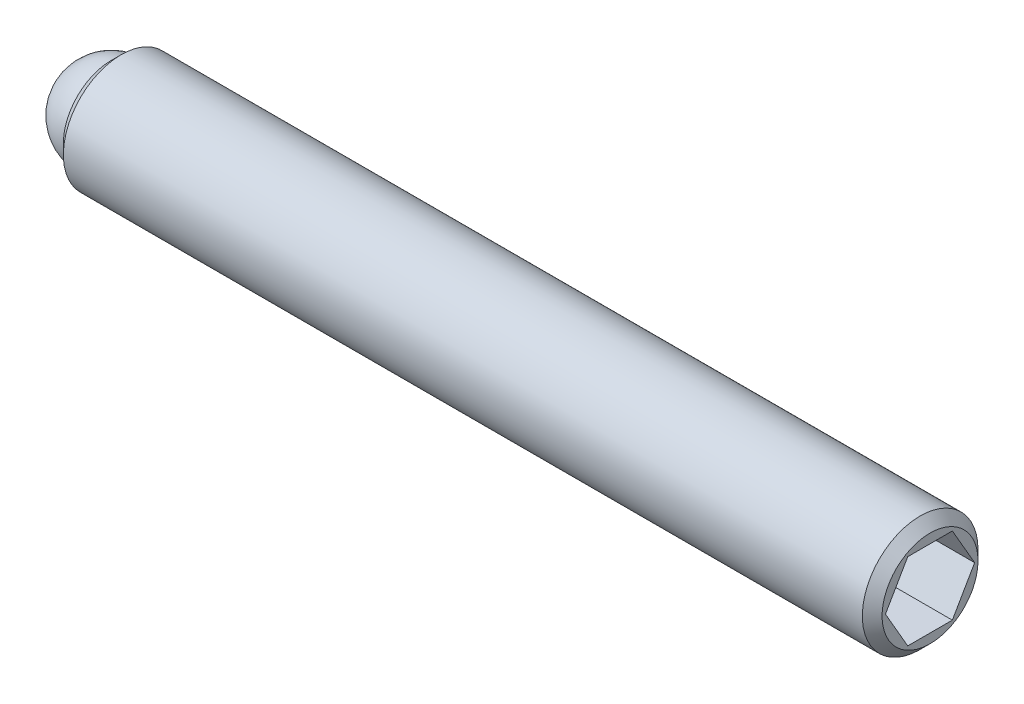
ISO-10303-21;
HEADER;
FILE_DESCRIPTION(('STEP AP214'),'2;1');
FILE_NAME('part.step','',(''),(''),'','','');
FILE_SCHEMA(('AUTOMOTIVE_DESIGN { 1 0 10303 214 1 1 1 1 }'));
ENDSEC;
DATA;
#1=APPLICATION_CONTEXT('core data for automotive mechanical design processes');
#2=APPLICATION_PROTOCOL_DEFINITION('international standard','automotive_design',2000,#1);
#3=PRODUCT_CONTEXT('',#1,'mechanical');
#4=PRODUCT('Part','Part','',(#3));
#5=PRODUCT_RELATED_PRODUCT_CATEGORY('part','',(#4));
#6=PRODUCT_DEFINITION_FORMATION('','',#4);
#7=PRODUCT_DEFINITION_CONTEXT('part definition',#1,'design');
#8=PRODUCT_DEFINITION('design','',#6,#7);
#9=PRODUCT_DEFINITION_SHAPE('','',#8);
#10=(LENGTH_UNIT() NAMED_UNIT(*) SI_UNIT(.MILLI.,.METRE.));
#11=(NAMED_UNIT(*) PLANE_ANGLE_UNIT() SI_UNIT($,.RADIAN.));
#12=(NAMED_UNIT(*) SI_UNIT($,.STERADIAN.) SOLID_ANGLE_UNIT());
#13=UNCERTAINTY_MEASURE_WITH_UNIT(LENGTH_MEASURE(1.E-05),#10,'distance_accuracy_value','');
#14=(GEOMETRIC_REPRESENTATION_CONTEXT(3) GLOBAL_UNCERTAINTY_ASSIGNED_CONTEXT((#13)) GLOBAL_UNIT_ASSIGNED_CONTEXT((#10,
#11,#12)) REPRESENTATION_CONTEXT('',''));
#15=CARTESIAN_POINT('',(0.,0.,0.));
#16=DIRECTION('',(0.,0.,1.));
#17=DIRECTION('',(1.,0.,0.));
#18=AXIS2_PLACEMENT_3D('',#15,#16,#17);
#19=CARTESIAN_POINT('',(0.,0.,0.));
#20=DIRECTION('',(0.,-1.,0.));
#21=DIRECTION('',(0.,0.,-1.));
#22=AXIS2_PLACEMENT_3D('',#19,#20,#21);
#23=SPHERICAL_SURFACE('',#22,1.190625);
#24=CARTESIAN_POINT('',(0.,-1.190625,0.));
#25=VERTEX_POINT('',#24);
#26=VERTEX_LOOP('',#25);
#27=FACE_BOUND('',#26,.T.);
#28=ADVANCED_FACE('F43',(#27),#23,.T.);
#29=CLOSED_SHELL('',(#28));
#30=MANIFOLD_SOLID_BREP('B2',#29);
#31=CARTESIAN_POINT('',(21.034375,0.,0.));
#32=DIRECTION('',(-1.,0.,0.));
#33=DIRECTION('',(0.,0.,1.));
#34=AXIS2_PLACEMENT_3D('',#31,#32,#33);
#35=CYLINDRICAL_SURFACE('',#34,1.4859);
#36=CARTESIAN_POINT('',(20.780375,0.,0.));
#37=DIRECTION('',(1.,0.,0.));
#38=DIRECTION('',(0.,0.,-1.));
#39=AXIS2_PLACEMENT_3D('',#36,#37,#38);
#40=CIRCLE('',#39,1.4859);
#41=CARTESIAN_POINT('',(20.780375,0.,-1.4859));
#42=VERTEX_POINT('',#41);
#43=EDGE_CURVE('E41',#42,#42,#40,.F.);
#44=ORIENTED_EDGE('',*,*,#43,.T.);
#45=EDGE_LOOP('',(#44));
#46=FACE_BOUND('',#45,.T.);
#47=CARTESIAN_POINT('',(0.254000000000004,0.,0.));
#48=DIRECTION('',(1.,0.,0.));
#49=DIRECTION('',(0.,0.,-1.));
#50=AXIS2_PLACEMENT_3D('',#47,#48,#49);
#51=CIRCLE('',#50,1.4859);
#52=CARTESIAN_POINT('',(0.254000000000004,0.,-1.4859));
#53=VERTEX_POINT('',#52);
#54=EDGE_CURVE('E159',#53,#53,#51,.T.);
#55=ORIENTED_EDGE('',*,*,#54,.T.);
#56=EDGE_LOOP('',(#55));
#57=FACE_BOUND('',#56,.T.);
#58=ADVANCED_FACE('F56',(#46,#57),#35,.T.);
#59=CARTESIAN_POINT('',(21.034375,0.,0.));
#60=DIRECTION('',(1.,0.,0.));
#61=DIRECTION('',(0.,0.,-1.));
#62=AXIS2_PLACEMENT_3D('',#59,#60,#61);
#63=PLANE('',#62);
#64=DIRECTION('',(0.,0.866025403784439,-0.5));
#65=VECTOR('',#64,1.);
#66=CARTESIAN_POINT('',(21.034375,-0.992187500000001,-0.572839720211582));
#67=LINE('',#66,#65);
#68=CARTESIAN_POINT('',(21.034375,-0.992187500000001,-0.572839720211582));
#69=VERTEX_POINT('',#68);
#70=CARTESIAN_POINT('',(21.034375,0.,-1.14567944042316));
#71=VERTEX_POINT('',#70);
#72=EDGE_CURVE('E71',#69,#71,#67,.T.);
#73=ORIENTED_EDGE('',*,*,#72,.F.);
#74=DIRECTION('',(0.,0.,-1.));
#75=VECTOR('',#74,1.);
#76=CARTESIAN_POINT('',(21.034375,-0.992187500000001,0.572839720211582));
#77=LINE('',#76,#75);
#78=CARTESIAN_POINT('',(21.034375,-0.992187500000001,0.572839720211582));
#79=VERTEX_POINT('',#78);
#80=EDGE_CURVE('E155',#79,#69,#77,.T.);
#81=ORIENTED_EDGE('',*,*,#80,.F.);
#82=DIRECTION('',(0.,-0.866025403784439,-0.5));
#83=VECTOR('',#82,1.);
#84=CARTESIAN_POINT('',(21.034375,0.,1.14567944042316));
#85=LINE('',#84,#83);
#86=CARTESIAN_POINT('',(21.034375,0.,1.14567944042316));
#87=VERTEX_POINT('',#86);
#88=EDGE_CURVE('E153',#87,#79,#85,.T.);
#89=ORIENTED_EDGE('',*,*,#88,.F.);
#90=DIRECTION('',(0.,-0.866025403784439,0.5));
#91=VECTOR('',#90,1.);
#92=CARTESIAN_POINT('',(21.034375,0.992187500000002,0.572839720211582));
#93=LINE('',#92,#91);
#94=CARTESIAN_POINT('',(21.034375,0.992187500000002,0.572839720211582));
#95=VERTEX_POINT('',#94);
#96=EDGE_CURVE('E119',#95,#87,#93,.T.);
#97=ORIENTED_EDGE('',*,*,#96,.F.);
#98=DIRECTION('',(0.,0.,1.));
#99=VECTOR('',#98,1.);
#100=CARTESIAN_POINT('',(21.034375,0.992187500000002,-0.572839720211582));
#101=LINE('',#100,#99);
#102=CARTESIAN_POINT('',(21.034375,0.992187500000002,-0.572839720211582));
#103=VERTEX_POINT('',#102);
#104=EDGE_CURVE('E149',#103,#95,#101,.T.);
#105=ORIENTED_EDGE('',*,*,#104,.F.);
#106=DIRECTION('',(0.,0.866025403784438,0.5));
#107=VECTOR('',#106,1.);
#108=CARTESIAN_POINT('',(21.034375,0.,-1.14567944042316));
#109=LINE('',#108,#107);
#110=EDGE_CURVE('E145',#71,#103,#109,.T.);
#111=ORIENTED_EDGE('',*,*,#110,.F.);
#112=EDGE_LOOP('',(#73,#81,#89,#97,#105,#111));
#113=FACE_BOUND('',#112,.T.);
#114=CARTESIAN_POINT('',(21.034375,0.,0.));
#115=DIRECTION('',(1.,0.,0.));
#116=DIRECTION('',(0.,0.,-1.));
#117=AXIS2_PLACEMENT_3D('',#114,#115,#116);
#118=CIRCLE('',#117,1.2319);
#119=CARTESIAN_POINT('',(21.034375,0.,-1.2319));
#120=VERTEX_POINT('',#119);
#121=EDGE_CURVE('E64',#120,#120,#118,.T.);
#122=ORIENTED_EDGE('',*,*,#121,.T.);
#123=EDGE_LOOP('',(#122));
#124=FACE_BOUND('',#123,.T.);
#125=ADVANCED_FACE('F172',(#113,#124),#63,.T.);
#126=CARTESIAN_POINT('',(0.,0.,0.));
#127=DIRECTION('',(1.,0.,0.));
#128=DIRECTION('',(0.,0.,-1.));
#129=AXIS2_PLACEMENT_3D('',#126,#127,#128);
#130=PLANE('',#129);
#131=CARTESIAN_POINT('',(0.,0.,0.));
#132=DIRECTION('',(-1.,0.,0.));
#133=DIRECTION('',(0.,0.,1.));
#134=AXIS2_PLACEMENT_3D('',#131,#132,#133);
#135=CIRCLE('',#134,1.190625);
#136=CARTESIAN_POINT('',(0.,0.,1.190625));
#137=VERTEX_POINT('',#136);
#138=EDGE_CURVE('E227',#137,#137,#135,.T.);
#139=ORIENTED_EDGE('',*,*,#138,.F.);
#140=EDGE_LOOP('',(#139));
#141=FACE_BOUND('',#140,.T.);
#142=CARTESIAN_POINT('',(0.,0.,0.));
#143=DIRECTION('',(1.,0.,0.));
#144=DIRECTION('',(0.,0.,-1.));
#145=AXIS2_PLACEMENT_3D('',#142,#143,#144);
#146=CIRCLE('',#145,1.2319);
#147=CARTESIAN_POINT('',(0.,0.,-1.2319));
#148=VERTEX_POINT('',#147);
#149=EDGE_CURVE('E167',#148,#148,#146,.F.);
#150=ORIENTED_EDGE('',*,*,#149,.T.);
#151=EDGE_LOOP('',(#150));
#152=FACE_BOUND('',#151,.T.);
#153=ADVANCED_FACE('F184',(#141,#152),#130,.F.);
#154=CARTESIAN_POINT('',(0.254000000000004,0.,0.));
#155=DIRECTION('',(1.,0.,0.));
#156=DIRECTION('',(0.,0.,-1.));
#157=AXIS2_PLACEMENT_3D('',#154,#155,#156);
#158=CONICAL_SURFACE('',#157,1.4859,0.785398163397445);
#159=ORIENTED_EDGE('',*,*,#149,.F.);
#160=EDGE_LOOP('',(#159));
#161=FACE_BOUND('',#160,.T.);
#162=ORIENTED_EDGE('',*,*,#54,.F.);
#163=EDGE_LOOP('',(#162));
#164=FACE_BOUND('',#163,.T.);
#165=ADVANCED_FACE('F176',(#161,#164),#158,.T.);
#166=CARTESIAN_POINT('',(21.034375,0.,0.));
#167=DIRECTION('',(-1.,0.,0.));
#168=DIRECTION('',(0.,0.,1.));
#169=AXIS2_PLACEMENT_3D('',#166,#167,#168);
#170=CONICAL_SURFACE('',#169,1.2319,0.785398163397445);
#171=ORIENTED_EDGE('',*,*,#43,.F.);
#172=EDGE_LOOP('',(#171));
#173=FACE_BOUND('',#172,.T.);
#174=ORIENTED_EDGE('',*,*,#121,.F.);
#175=EDGE_LOOP('',(#174));
#176=FACE_BOUND('',#175,.T.);
#177=ADVANCED_FACE('F58',(#173,#176),#170,.T.);
#178=CARTESIAN_POINT('',(18.748375,-0.992187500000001,-0.572839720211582));
#179=DIRECTION('',(0.,-0.5,-0.866025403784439));
#180=DIRECTION('',(0.,0.866025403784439,-0.5));
#181=AXIS2_PLACEMENT_3D('',#178,#179,#180);
#182=PLANE('',#181);
#183=ORIENTED_EDGE('',*,*,#72,.T.);
#184=DIRECTION('',(1.,0.,0.));
#185=VECTOR('',#184,1.);
#186=CARTESIAN_POINT('',(18.748375,0.,-1.14567944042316));
#187=LINE('',#186,#185);
#188=CARTESIAN_POINT('',(18.748375,0.,-1.14567944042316));
#189=VERTEX_POINT('',#188);
#190=EDGE_CURVE('E101',#189,#71,#187,.T.);
#191=ORIENTED_EDGE('',*,*,#190,.F.);
#192=DIRECTION('',(0.,0.866025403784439,-0.5));
#193=VECTOR('',#192,1.);
#194=CARTESIAN_POINT('',(18.748375,-0.992187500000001,-0.572839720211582));
#195=LINE('',#194,#193);
#196=CARTESIAN_POINT('',(18.748375,-0.992187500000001,-0.572839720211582));
#197=VERTEX_POINT('',#196);
#198=EDGE_CURVE('E157',#197,#189,#195,.T.);
#199=ORIENTED_EDGE('',*,*,#198,.F.);
#200=DIRECTION('',(1.,0.,0.));
#201=VECTOR('',#200,1.);
#202=CARTESIAN_POINT('',(18.748375,-0.992187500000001,-0.572839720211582));
#203=LINE('',#202,#201);
#204=EDGE_CURVE('E79',#197,#69,#203,.T.);
#205=ORIENTED_EDGE('',*,*,#204,.T.);
#206=EDGE_LOOP('',(#183,#191,#199,#205));
#207=FACE_BOUND('',#206,.T.);
#208=ADVANCED_FACE('F175',(#207),#182,.F.);
#209=CARTESIAN_POINT('',(18.748375,-0.992187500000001,0.572839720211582));
#210=DIRECTION('',(0.,-1.,0.));
#211=DIRECTION('',(0.,0.,-1.));
#212=AXIS2_PLACEMENT_3D('',#209,#210,#211);
#213=PLANE('',#212);
#214=ORIENTED_EDGE('',*,*,#80,.T.);
#215=ORIENTED_EDGE('',*,*,#204,.F.);
#216=DIRECTION('',(0.,0.,-1.));
#217=VECTOR('',#216,1.);
#218=CARTESIAN_POINT('',(18.748375,-0.992187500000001,0.572839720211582));
#219=LINE('',#218,#217);
#220=CARTESIAN_POINT('',(18.748375,-0.992187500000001,0.572839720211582));
#221=VERTEX_POINT('',#220);
#222=EDGE_CURVE('E131',#221,#197,#219,.T.);
#223=ORIENTED_EDGE('',*,*,#222,.F.);
#224=DIRECTION('',(1.,0.,0.));
#225=VECTOR('',#224,1.);
#226=CARTESIAN_POINT('',(18.748375,-0.992187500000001,0.572839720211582));
#227=LINE('',#226,#225);
#228=EDGE_CURVE('E123',#221,#79,#227,.T.);
#229=ORIENTED_EDGE('',*,*,#228,.T.);
#230=EDGE_LOOP('',(#214,#215,#223,#229));
#231=FACE_BOUND('',#230,.T.);
#232=ADVANCED_FACE('F182',(#231),#213,.F.);
#233=CARTESIAN_POINT('',(18.748375,0.,1.14567944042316));
#234=DIRECTION('',(0.,-0.5,0.866025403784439));
#235=DIRECTION('',(0.,-0.866025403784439,-0.5));
#236=AXIS2_PLACEMENT_3D('',#233,#234,#235);
#237=PLANE('',#236);
#238=ORIENTED_EDGE('',*,*,#88,.T.);
#239=ORIENTED_EDGE('',*,*,#228,.F.);
#240=DIRECTION('',(0.,-0.866025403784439,-0.5));
#241=VECTOR('',#240,1.);
#242=CARTESIAN_POINT('',(18.748375,0.,1.14567944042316));
#243=LINE('',#242,#241);
#244=CARTESIAN_POINT('',(18.748375,0.,1.14567944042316));
#245=VERTEX_POINT('',#244);
#246=EDGE_CURVE('E127',#245,#221,#243,.T.);
#247=ORIENTED_EDGE('',*,*,#246,.F.);
#248=DIRECTION('',(1.,0.,0.));
#249=VECTOR('',#248,1.);
#250=CARTESIAN_POINT('',(18.748375,0.,1.14567944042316));
#251=LINE('',#250,#249);
#252=EDGE_CURVE('E112',#245,#87,#251,.T.);
#253=ORIENTED_EDGE('',*,*,#252,.T.);
#254=EDGE_LOOP('',(#238,#239,#247,#253));
#255=FACE_BOUND('',#254,.T.);
#256=ADVANCED_FACE('F128',(#255),#237,.F.);
#257=CARTESIAN_POINT('',(18.748375,0.992187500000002,0.572839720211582));
#258=DIRECTION('',(0.,0.5,0.866025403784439));
#259=DIRECTION('',(0.,-0.866025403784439,0.5));
#260=AXIS2_PLACEMENT_3D('',#257,#258,#259);
#261=PLANE('',#260);
#262=ORIENTED_EDGE('',*,*,#96,.T.);
#263=ORIENTED_EDGE('',*,*,#252,.F.);
#264=DIRECTION('',(0.,-0.866025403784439,0.5));
#265=VECTOR('',#264,1.);
#266=CARTESIAN_POINT('',(18.748375,0.992187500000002,0.572839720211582));
#267=LINE('',#266,#265);
#268=CARTESIAN_POINT('',(18.748375,0.992187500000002,0.572839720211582));
#269=VERTEX_POINT('',#268);
#270=EDGE_CURVE('E116',#269,#245,#267,.T.);
#271=ORIENTED_EDGE('',*,*,#270,.F.);
#272=DIRECTION('',(1.,0.,0.));
#273=VECTOR('',#272,1.);
#274=CARTESIAN_POINT('',(18.748375,0.992187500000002,0.572839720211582));
#275=LINE('',#274,#273);
#276=EDGE_CURVE('E124',#269,#95,#275,.T.);
#277=ORIENTED_EDGE('',*,*,#276,.T.);
#278=EDGE_LOOP('',(#262,#263,#271,#277));
#279=FACE_BOUND('',#278,.T.);
#280=ADVANCED_FACE('F114',(#279),#261,.F.);
#281=CARTESIAN_POINT('',(18.748375,0.992187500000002,-0.572839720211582));
#282=DIRECTION('',(0.,1.,0.));
#283=DIRECTION('',(0.,0.,1.));
#284=AXIS2_PLACEMENT_3D('',#281,#282,#283);
#285=PLANE('',#284);
#286=ORIENTED_EDGE('',*,*,#104,.T.);
#287=ORIENTED_EDGE('',*,*,#276,.F.);
#288=DIRECTION('',(0.,0.,1.));
#289=VECTOR('',#288,1.);
#290=CARTESIAN_POINT('',(18.748375,0.992187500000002,-0.572839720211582));
#291=LINE('',#290,#289);
#292=CARTESIAN_POINT('',(18.748375,0.992187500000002,-0.572839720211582));
#293=VERTEX_POINT('',#292);
#294=EDGE_CURVE('E137',#293,#269,#291,.T.);
#295=ORIENTED_EDGE('',*,*,#294,.F.);
#296=DIRECTION('',(1.,0.,0.));
#297=VECTOR('',#296,1.);
#298=CARTESIAN_POINT('',(18.748375,0.992187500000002,-0.572839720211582));
#299=LINE('',#298,#297);
#300=EDGE_CURVE('E162',#293,#103,#299,.T.);
#301=ORIENTED_EDGE('',*,*,#300,.T.);
#302=EDGE_LOOP('',(#286,#287,#295,#301));
#303=FACE_BOUND('',#302,.T.);
#304=ADVANCED_FACE('F203',(#303),#285,.F.);
#305=CARTESIAN_POINT('',(18.748375,0.,-1.14567944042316));
#306=DIRECTION('',(0.,0.5,-0.866025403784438));
#307=DIRECTION('',(0.,0.866025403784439,0.5));
#308=AXIS2_PLACEMENT_3D('',#305,#306,#307);
#309=PLANE('',#308);
#310=ORIENTED_EDGE('',*,*,#110,.T.);
#311=ORIENTED_EDGE('',*,*,#300,.F.);
#312=DIRECTION('',(0.,0.866025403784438,0.5));
#313=VECTOR('',#312,1.);
#314=CARTESIAN_POINT('',(18.748375,0.,-1.14567944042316));
#315=LINE('',#314,#313);
#316=EDGE_CURVE('E139',#189,#293,#315,.T.);
#317=ORIENTED_EDGE('',*,*,#316,.F.);
#318=ORIENTED_EDGE('',*,*,#190,.T.);
#319=EDGE_LOOP('',(#310,#311,#317,#318));
#320=FACE_BOUND('',#319,.T.);
#321=ADVANCED_FACE('F200',(#320),#309,.F.);
#322=CARTESIAN_POINT('',(18.748375,0.,0.));
#323=DIRECTION('',(1.,0.,0.));
#324=DIRECTION('',(0.,0.,-1.));
#325=AXIS2_PLACEMENT_3D('',#322,#323,#324);
#326=PLANE('',#325);
#327=ORIENTED_EDGE('',*,*,#198,.T.);
#328=ORIENTED_EDGE('',*,*,#316,.T.);
#329=ORIENTED_EDGE('',*,*,#294,.T.);
#330=ORIENTED_EDGE('',*,*,#270,.T.);
#331=ORIENTED_EDGE('',*,*,#246,.T.);
#332=ORIENTED_EDGE('',*,*,#222,.T.);
#333=EDGE_LOOP('',(#327,#328,#329,#330,#331,#332));
#334=FACE_BOUND('',#333,.T.);
#335=ADVANCED_FACE('F134',(#334),#326,.T.);
#336=CARTESIAN_POINT('',(1.190625,0.,0.));
#337=DIRECTION('',(-1.,0.,0.));
#338=DIRECTION('',(0.,0.,1.));
#339=AXIS2_PLACEMENT_3D('',#336,#337,#338);
#340=CYLINDRICAL_SURFACE('',#339,1.190625);
#341=CARTESIAN_POINT('',(1.190625,0.,0.));
#342=DIRECTION('',(-1.,0.,0.));
#343=DIRECTION('',(0.,0.,1.));
#344=AXIS2_PLACEMENT_3D('',#341,#342,#343);
#345=CIRCLE('',#344,1.190625);
#346=CARTESIAN_POINT('',(1.190625,0.,1.190625));
#347=VERTEX_POINT('',#346);
#348=EDGE_CURVE('E146',#347,#347,#345,.T.);
#349=CARTESIAN_POINT('',(1.190625,0.,1.190625));
#350=CARTESIAN_POINT('',(1.17822265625,0.,1.190625));
#351=CARTESIAN_POINT('',(1.1658203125,0.,1.190625));
#352=CARTESIAN_POINT('',(1.141015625,0.,1.190625));
#353=CARTESIAN_POINT('',(1.12861328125,0.,1.190625));
#354=CARTESIAN_POINT('',(1.10380859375,0.,1.190625));
#355=CARTESIAN_POINT('',(1.09140625,0.,1.190625));
#356=CARTESIAN_POINT('',(1.0666015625,0.,1.190625));
#357=CARTESIAN_POINT('',(1.05419921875,0.,1.190625));
#358=CARTESIAN_POINT('',(1.02939453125,0.,1.190625));
#359=CARTESIAN_POINT('',(1.0169921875,0.,1.190625));
#360=CARTESIAN_POINT('',(0.9921875,0.,1.190625));
#361=CARTESIAN_POINT('',(0.97978515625,0.,1.190625));
#362=CARTESIAN_POINT('',(0.95498046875,0.,1.190625));
#363=CARTESIAN_POINT('',(0.942578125,0.,1.190625));
#364=CARTESIAN_POINT('',(0.9177734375,0.,1.190625));
#365=CARTESIAN_POINT('',(0.90537109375,0.,1.190625));
#366=CARTESIAN_POINT('',(0.88056640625,0.,1.190625));
#367=CARTESIAN_POINT('',(0.8681640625,0.,1.190625));
#368=CARTESIAN_POINT('',(0.843359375,0.,1.190625));
#369=CARTESIAN_POINT('',(0.83095703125,0.,1.190625));
#370=CARTESIAN_POINT('',(0.80615234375,0.,1.190625));
#371=CARTESIAN_POINT('',(0.79375,0.,1.190625));
#372=CARTESIAN_POINT('',(0.7689453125,0.,1.190625));
#373=CARTESIAN_POINT('',(0.75654296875,0.,1.190625));
#374=CARTESIAN_POINT('',(0.73173828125,0.,1.190625));
#375=CARTESIAN_POINT('',(0.7193359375,0.,1.190625));
#376=CARTESIAN_POINT('',(0.69453125,0.,1.190625));
#377=CARTESIAN_POINT('',(0.68212890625,0.,1.190625));
#378=CARTESIAN_POINT('',(0.65732421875,0.,1.190625));
#379=CARTESIAN_POINT('',(0.644921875,0.,1.190625));
#380=CARTESIAN_POINT('',(0.6201171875,0.,1.190625));
#381=CARTESIAN_POINT('',(0.60771484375,0.,1.190625));
#382=CARTESIAN_POINT('',(0.58291015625,0.,1.190625));
#383=CARTESIAN_POINT('',(0.5705078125,0.,1.190625));
#384=CARTESIAN_POINT('',(0.545703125,0.,1.190625));
#385=CARTESIAN_POINT('',(0.53330078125,0.,1.190625));
#386=CARTESIAN_POINT('',(0.50849609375,0.,1.190625));
#387=CARTESIAN_POINT('',(0.49609375,0.,1.190625));
#388=CARTESIAN_POINT('',(0.4712890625,0.,1.190625));
#389=CARTESIAN_POINT('',(0.45888671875,0.,1.190625));
#390=CARTESIAN_POINT('',(0.43408203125,0.,1.190625));
#391=CARTESIAN_POINT('',(0.4216796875,0.,1.190625));
#392=CARTESIAN_POINT('',(0.396875,0.,1.190625));
#393=CARTESIAN_POINT('',(0.38447265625,0.,1.190625));
#394=CARTESIAN_POINT('',(0.35966796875,0.,1.190625));
#395=CARTESIAN_POINT('',(0.347265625,0.,1.190625));
#396=CARTESIAN_POINT('',(0.3224609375,0.,1.190625));
#397=CARTESIAN_POINT('',(0.31005859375,0.,1.190625));
#398=CARTESIAN_POINT('',(0.28525390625,0.,1.190625));
#399=CARTESIAN_POINT('',(0.2728515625,0.,1.190625));
#400=CARTESIAN_POINT('',(0.248046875,0.,1.190625));
#401=CARTESIAN_POINT('',(0.23564453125,0.,1.190625));
#402=CARTESIAN_POINT('',(0.21083984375,0.,1.190625));
#403=CARTESIAN_POINT('',(0.1984375,0.,1.190625));
#404=CARTESIAN_POINT('',(0.1736328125,0.,1.190625));
#405=CARTESIAN_POINT('',(0.16123046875,0.,1.190625));
#406=CARTESIAN_POINT('',(0.13642578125,0.,1.190625));
#407=CARTESIAN_POINT('',(0.1240234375,0.,1.190625));
#408=CARTESIAN_POINT('',(0.0992187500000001,0.,1.190625));
#409=CARTESIAN_POINT('',(0.08681640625,0.,1.190625));
#410=CARTESIAN_POINT('',(0.06201171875,0.,1.190625));
#411=CARTESIAN_POINT('',(0.049609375,0.,1.190625));
#412=CARTESIAN_POINT('',(0.0248046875,0.,1.190625));
#413=CARTESIAN_POINT('',(0.01240234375,0.,1.190625));
#414=CARTESIAN_POINT('',(0.,0.,1.190625));
#415=B_SPLINE_CURVE_WITH_KNOTS('',3,(#349,#350,#351,#352,#353,#354,#355,#356,#357,#358,#359,
#360,#361,#362,#363,#364,#365,#366,#367,#368,#369,#370,#371,#372,#373,#374,#375,#376,#377,#378,
#379,#380,#381,#382,#383,#384,#385,#386,#387,#388,#389,#390,#391,#392,#393,#394,#395,#396,#397,
#398,#399,#400,#401,#402,#403,#404,#405,#406,#407,#408,#409,#410,#411,#412,#413,#414),
.UNSPECIFIED.,.F.,.F.,(4,2,2,2,2,2,2,2,2,2,2,2,2,2,2,2,2,2,2,2,2,2,2,2,2,2,2,2,2,2,2,2,4),(0.,
0.03720703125,0.0744140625,0.11162109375,0.148828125,0.18603515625,0.2232421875,0.26044921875,
0.29765625,0.33486328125,0.3720703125,0.40927734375,0.446484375,0.48369140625,0.5208984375,
0.55810546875,0.5953125,0.63251953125,0.6697265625,0.70693359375,0.744140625,0.78134765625,
0.8185546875,0.85576171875,0.89296875,0.93017578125,0.9673828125,1.00458984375,1.041796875,
1.07900390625,1.1162109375,1.15341796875,1.190625),.UNSPECIFIED.);
#416=EDGE_CURVE('BSEAM216',#347,#137,#415,.T.);
#417=ORIENTED_EDGE('',*,*,#348,.F.);
#418=ORIENTED_EDGE('',*,*,#138,.T.);
#419=ORIENTED_EDGE('',*,*,#416,.T.);
#420=ORIENTED_EDGE('',*,*,#416,.F.);
#421=EDGE_LOOP('',(#417,#419,#418,#420));
#422=FACE_BOUND('',#421,.T.);
#423=ADVANCED_FACE('F216',(#422),#340,.F.);
#424=CARTESIAN_POINT('',(1.190625,0.,0.));
#425=DIRECTION('',(-1.,0.,0.));
#426=DIRECTION('',(0.,0.,1.));
#427=AXIS2_PLACEMENT_3D('',#424,#425,#426);
#428=PLANE('',#427);
#429=ORIENTED_EDGE('',*,*,#348,.T.);
#430=EDGE_LOOP('',(#429));
#431=FACE_BOUND('',#430,.T.);
#432=ADVANCED_FACE('F219',(#431),#428,.T.);
#433=CLOSED_SHELL('',(#58,#125,#153,#165,#177,#208,#232,#256,#280,#304,#321,#335,#423,#432));
#434=MANIFOLD_SOLID_BREP('B6',#433);
#435=ADVANCED_BREP_SHAPE_REPRESENTATION('',(#18,#30,#434),#14);
#436=SHAPE_DEFINITION_REPRESENTATION(#9,#435);
ENDSEC;
END-ISO-10303-21;
